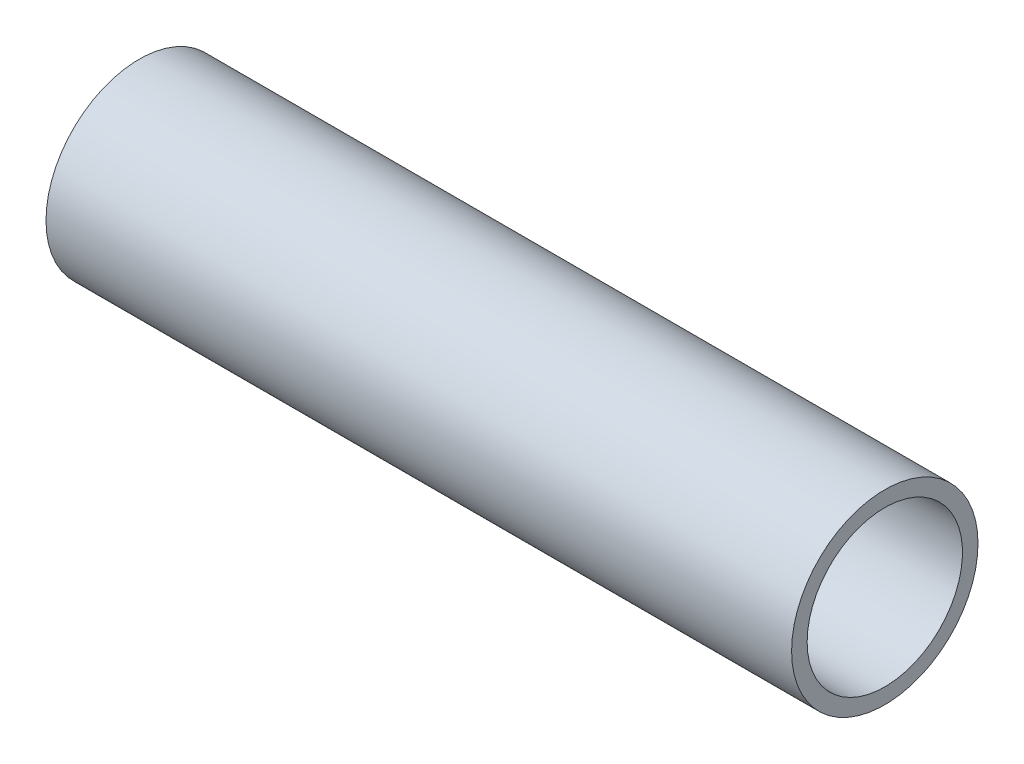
from build123d import *

# Parameters (mm, degrees)
SCHIZZO1_W = 48
SCHIZZO1_H = 1


with BuildPart() as part:
    # Schizzo1 → Rivoluzione1 (revolve)
    with BuildSketch(Plane.XY, mode=Mode.PRIVATE) as rivoluzione1_sk:
        with Locations((5.619823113, 5.5)):
            Rectangle(SCHIZZO1_W, SCHIZZO1_H)
    revolve(rivoluzione1_sk.sketch.rotate(Axis((-25.572018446, 0, 0), (1, 0, 0)), 90), axis=Axis((-25.572018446, 0, 0), (1, 0, 0)))


solid = part.part
